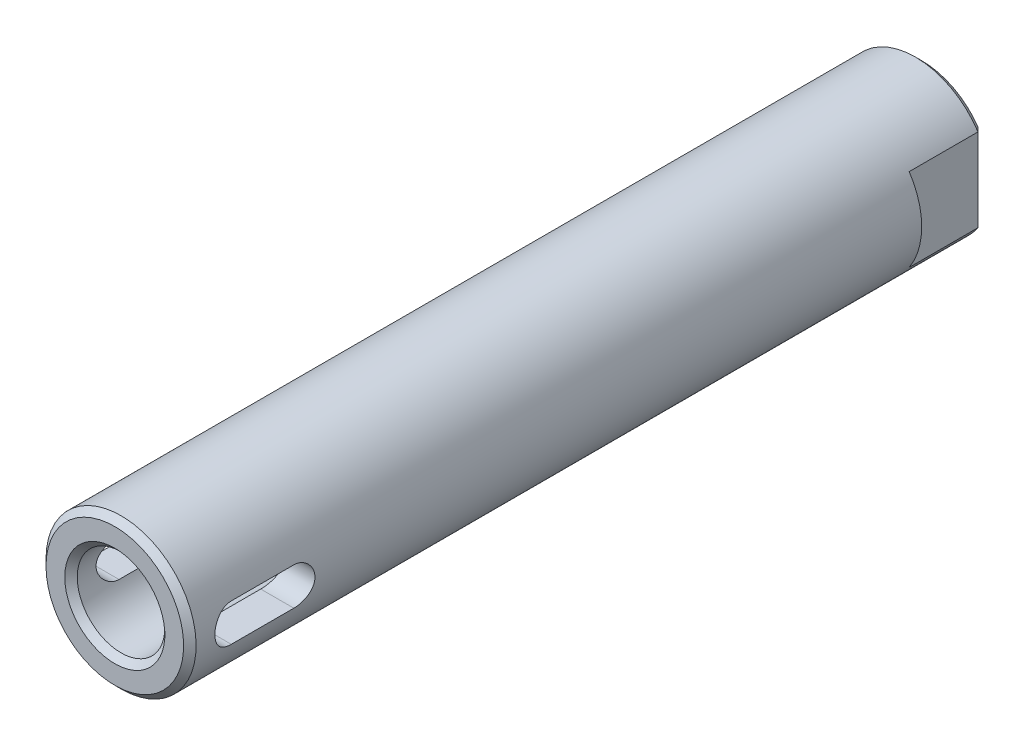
ISO-10303-21;
HEADER;
FILE_DESCRIPTION(('STEP AP214'),'2;1');
FILE_NAME('part.step','',(''),(''),'','','');
FILE_SCHEMA(('AUTOMOTIVE_DESIGN { 1 0 10303 214 1 1 1 1 }'));
ENDSEC;
DATA;
#1=APPLICATION_CONTEXT('core data for automotive mechanical design processes');
#2=APPLICATION_PROTOCOL_DEFINITION('international standard','automotive_design',2000,#1);
#3=PRODUCT_CONTEXT('',#1,'mechanical');
#4=PRODUCT('Part','Part','',(#3));
#5=PRODUCT_RELATED_PRODUCT_CATEGORY('part','',(#4));
#6=PRODUCT_DEFINITION_FORMATION('','',#4);
#7=PRODUCT_DEFINITION_CONTEXT('part definition',#1,'design');
#8=PRODUCT_DEFINITION('design','',#6,#7);
#9=PRODUCT_DEFINITION_SHAPE('','',#8);
#10=(LENGTH_UNIT() NAMED_UNIT(*) SI_UNIT(.MILLI.,.METRE.));
#11=(NAMED_UNIT(*) PLANE_ANGLE_UNIT() SI_UNIT($,.RADIAN.));
#12=(NAMED_UNIT(*) SI_UNIT($,.STERADIAN.) SOLID_ANGLE_UNIT());
#13=UNCERTAINTY_MEASURE_WITH_UNIT(LENGTH_MEASURE(1.E-05),#10,'distance_accuracy_value','');
#14=(GEOMETRIC_REPRESENTATION_CONTEXT(3) GLOBAL_UNCERTAINTY_ASSIGNED_CONTEXT((#13)) GLOBAL_UNIT_ASSIGNED_CONTEXT((#10,
#11,#12)) REPRESENTATION_CONTEXT('',''));
#15=CARTESIAN_POINT('',(0.,0.,0.));
#16=DIRECTION('',(0.,0.,1.));
#17=DIRECTION('',(1.,0.,0.));
#18=AXIS2_PLACEMENT_3D('',#15,#16,#17);
#19=CARTESIAN_POINT('',(0.,0.,0.));
#20=DIRECTION('',(0.,0.,1.));
#21=DIRECTION('',(1.,0.,0.));
#22=AXIS2_PLACEMENT_3D('',#19,#20,#21);
#23=CONICAL_SURFACE('',#22,5.5,0.785398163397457);
#24=CARTESIAN_POINT('',(0.,0.,0.));
#25=DIRECTION('',(0.,0.,-1.));
#26=DIRECTION('',(-1.,0.,0.));
#27=AXIS2_PLACEMENT_3D('',#24,#25,#26);
#28=CIRCLE('',#27,5.5);
#29=CARTESIAN_POINT('',(-4.5,3.16227766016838,0.));
#30=VERTEX_POINT('',#29);
#31=CARTESIAN_POINT('',(4.5,3.16227766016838,0.));
#32=VERTEX_POINT('',#31);
#33=EDGE_CURVE('E257',#30,#32,#28,.T.);
#34=ORIENTED_EDGE('',*,*,#33,.F.);
#35=CARTESIAN_POINT('',(-4.5,3.16227766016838,0.));
#36=CARTESIAN_POINT('',(-4.58324307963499,3.18858707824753,0.0832430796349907));
#37=CARTESIAN_POINT('',(-4.66653129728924,3.21460405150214,0.166531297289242));
#38=CARTESIAN_POINT('',(-4.83319796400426,3.26605309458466,0.333197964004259));
#39=CARTESIAN_POINT('',(-4.91657641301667,3.29148516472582,0.416576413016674));
#40=CARTESIAN_POINT('',(-5.,3.31662479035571,0.5));
#41=B_SPLINE_CURVE_WITH_KNOTS('',3,(#35,#36,#37,#38,#39,#40),.UNSPECIFIED.,.F.,.F.,(4,2,4),(0.,
0.361879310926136,0.723758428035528),.UNSPECIFIED.);
#42=CARTESIAN_POINT('',(-5.,3.31662479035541,0.5));
#43=VERTEX_POINT('',#42);
#44=EDGE_CURVE('E295',#30,#43,#41,.T.);
#45=ORIENTED_EDGE('',*,*,#44,.T.);
#46=CARTESIAN_POINT('',(0.,0.,0.5));
#47=DIRECTION('',(0.,0.,-1.));
#48=DIRECTION('',(-1.,0.,0.));
#49=AXIS2_PLACEMENT_3D('',#46,#47,#48);
#50=CIRCLE('',#49,6.);
#51=CARTESIAN_POINT('',(5.,3.31662479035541,0.5));
#52=VERTEX_POINT('',#51);
#53=EDGE_CURVE('E248',#52,#43,#50,.F.);
#54=ORIENTED_EDGE('',*,*,#53,.F.);
#55=CARTESIAN_POINT('',(5.,3.31662479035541,0.5));
#56=CARTESIAN_POINT('',(4.91657641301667,3.29148516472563,0.416576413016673));
#57=CARTESIAN_POINT('',(4.83319796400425,3.26605309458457,0.333197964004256));
#58=CARTESIAN_POINT('',(4.66653129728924,3.21460405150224,0.166531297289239));
#59=CARTESIAN_POINT('',(4.58324307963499,3.18858707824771,0.0832430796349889));
#60=CARTESIAN_POINT('',(4.5,3.16227766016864,0.));
#61=B_SPLINE_CURVE_WITH_KNOTS('',3,(#55,#56,#57,#58,#59,#60),.UNSPECIFIED.,.F.,.F.,(4,2,4),(0.,
0.361879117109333,0.723758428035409),.UNSPECIFIED.);
#62=EDGE_CURVE('E288',#52,#32,#61,.T.);
#63=ORIENTED_EDGE('',*,*,#62,.T.);
#64=EDGE_LOOP('',(#34,#45,#54,#63));
#65=FACE_BOUND('',#64,.T.);
#66=ADVANCED_FACE('F14',(#65),#23,.T.);
#67=CARTESIAN_POINT('',(0.,0.,0.));
#68=DIRECTION('',(0.,0.,1.));
#69=DIRECTION('',(1.,0.,0.));
#70=AXIS2_PLACEMENT_3D('',#67,#68,#69);
#71=CYLINDRICAL_SURFACE('',#70,6.);
#72=ORIENTED_EDGE('',*,*,#53,.T.);
#73=DIRECTION('',(0.,0.,-1.));
#74=VECTOR('',#73,1.);
#75=CARTESIAN_POINT('',(-5.,3.31662479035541,6.));
#76=LINE('',#75,#74);
#77=CARTESIAN_POINT('',(-5.,3.31662479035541,6.));
#78=VERTEX_POINT('',#77);
#79=EDGE_CURVE('E373',#78,#43,#76,.T.);
#80=ORIENTED_EDGE('',*,*,#79,.F.);
#81=CARTESIAN_POINT('',(0.,0.,6.));
#82=DIRECTION('',(0.,0.,-1.));
#83=DIRECTION('',(-1.,0.,0.));
#84=AXIS2_PLACEMENT_3D('',#81,#82,#83);
#85=CIRCLE('',#84,6.);
#86=CARTESIAN_POINT('',(-5.,-3.31662479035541,6.));
#87=VERTEX_POINT('',#86);
#88=EDGE_CURVE('E411',#87,#78,#85,.T.);
#89=ORIENTED_EDGE('',*,*,#88,.F.);
#90=DIRECTION('',(0.,0.,-1.));
#91=VECTOR('',#90,1.);
#92=CARTESIAN_POINT('',(-5.,-3.31662479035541,6.));
#93=LINE('',#92,#91);
#94=CARTESIAN_POINT('',(-5.,-3.31662479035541,0.5));
#95=VERTEX_POINT('',#94);
#96=EDGE_CURVE('E354',#87,#95,#93,.T.);
#97=ORIENTED_EDGE('',*,*,#96,.T.);
#98=CARTESIAN_POINT('',(5.,-3.31662479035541,0.5));
#99=VERTEX_POINT('',#98);
#100=EDGE_CURVE('E247',#95,#99,#50,.F.);
#101=ORIENTED_EDGE('',*,*,#100,.T.);
#102=DIRECTION('',(0.,0.,-1.));
#103=VECTOR('',#102,1.);
#104=CARTESIAN_POINT('',(5.,-3.31662479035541,6.));
#105=LINE('',#104,#103);
#106=CARTESIAN_POINT('',(5.,-3.31662479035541,6.));
#107=VERTEX_POINT('',#106);
#108=EDGE_CURVE('E352',#107,#99,#105,.T.);
#109=ORIENTED_EDGE('',*,*,#108,.F.);
#110=CARTESIAN_POINT('',(0.,0.,6.));
#111=DIRECTION('',(0.,0.,-1.));
#112=DIRECTION('',(1.,0.,0.));
#113=AXIS2_PLACEMENT_3D('',#110,#111,#112);
#114=CIRCLE('',#113,6.);
#115=CARTESIAN_POINT('',(5.,3.31662479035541,6.));
#116=VERTEX_POINT('',#115);
#117=EDGE_CURVE('E378',#116,#107,#114,.T.);
#118=ORIENTED_EDGE('',*,*,#117,.F.);
#119=DIRECTION('',(0.,0.,-1.));
#120=VECTOR('',#119,1.);
#121=CARTESIAN_POINT('',(5.,3.31662479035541,6.));
#122=LINE('',#121,#120);
#123=EDGE_CURVE('E143',#116,#52,#122,.T.);
#124=ORIENTED_EDGE('',*,*,#123,.T.);
#125=EDGE_LOOP('',(#72,#80,#89,#97,#101,#109,#118,#124));
#126=FACE_BOUND('',#125,.T.);
#127=DIRECTION('',(0.,0.,1.));
#128=VECTOR('',#127,1.);
#129=CARTESIAN_POINT('',(-5.80947501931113,1.5,0.));
#130=LINE('',#129,#128);
#131=CARTESIAN_POINT('',(-5.80947501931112,1.5,56.));
#132=VERTEX_POINT('',#131);
#133=CARTESIAN_POINT('',(-5.80947501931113,1.5,61.));
#134=VERTEX_POINT('',#133);
#135=EDGE_CURVE('E399',#132,#134,#130,.T.);
#136=ORIENTED_EDGE('',*,*,#135,.T.);
#137=CARTESIAN_POINT('',(-5.80947501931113,1.5,61.));
#138=CARTESIAN_POINT('',(-5.80947222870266,1.50000050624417,61.0414944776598));
#139=CARTESIAN_POINT('',(-5.80992014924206,1.49827711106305,61.0829683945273));
#140=CARTESIAN_POINT('',(-5.81168857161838,1.49140694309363,61.1656060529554));
#141=CARTESIAN_POINT('',(-5.8130089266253,1.48626074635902,61.2067698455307));
#142=CARTESIAN_POINT('',(-5.81822566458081,1.46576285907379,61.3291797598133));
#143=CARTESIAN_POINT('',(-5.82337804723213,1.44535154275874,61.4095847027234));
#144=CARTESIAN_POINT('',(-5.83643133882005,1.39169711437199,61.565687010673));
#145=CARTESIAN_POINT('',(-5.84433198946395,1.35845520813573,61.6413848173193));
#146=CARTESIAN_POINT('',(-5.86198701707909,1.28012306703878,61.786167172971));
#147=CARTESIAN_POINT('',(-5.87174189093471,1.2350296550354,61.8552499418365));
#148=CARTESIAN_POINT('',(-5.89224393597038,1.1332267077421,61.9863158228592));
#149=CARTESIAN_POINT('',(-5.90300686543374,1.07630590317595,62.0481323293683));
#150=CARTESIAN_POINT('',(-5.92417656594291,0.952913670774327,62.1614531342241));
#151=CARTESIAN_POINT('',(-5.93458327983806,0.886440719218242,62.2129557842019));
#152=CARTESIAN_POINT('',(-5.95404273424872,0.744685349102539,62.304866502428));
#153=CARTESIAN_POINT('',(-5.96307457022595,0.669293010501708,62.345109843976));
#154=CARTESIAN_POINT('',(-5.97858519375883,0.512553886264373,62.412287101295));
#155=CARTESIAN_POINT('',(-5.98506448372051,0.431208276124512,62.4392236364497));
#156=CARTESIAN_POINT('',(-5.99462850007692,0.26661616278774,62.4784884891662));
#157=CARTESIAN_POINT('',(-5.99777929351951,0.183441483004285,62.4911015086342));
#158=CARTESIAN_POINT('',(-6.00056157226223,0.0160991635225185,62.5022550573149));
#159=CARTESIAN_POINT('',(-6.00019349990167,-0.0680683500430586,62.5007973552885));
#160=CARTESIAN_POINT('',(-5.99602856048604,-0.233028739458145,62.4840550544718));
#161=CARTESIAN_POINT('',(-5.99230798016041,-0.313855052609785,62.4690780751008));
#162=CARTESIAN_POINT('',(-5.98194495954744,-0.471808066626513,62.4262169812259));
#163=CARTESIAN_POINT('',(-5.97530238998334,-0.548934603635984,62.3983322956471));
#164=CARTESIAN_POINT('',(-5.95972496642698,-0.698110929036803,62.330198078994));
#165=CARTESIAN_POINT('',(-5.95076990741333,-0.770108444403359,62.2898389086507));
#166=CARTESIAN_POINT('',(-5.93153918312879,-0.906414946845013,62.1979853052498));
#167=CARTESIAN_POINT('',(-5.92126331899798,-0.970722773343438,62.1464891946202));
#168=CARTESIAN_POINT('',(-5.90018349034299,-1.09165408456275,62.0321816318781));
#169=CARTESIAN_POINT('',(-5.88937275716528,-1.14802365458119,61.9691025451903));
#170=CARTESIAN_POINT('',(-5.8686925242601,-1.24945436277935,61.8342551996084));
#171=CARTESIAN_POINT('',(-5.85882328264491,-1.29451240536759,61.7624845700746));
#172=CARTESIAN_POINT('',(-5.84111720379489,-1.37220706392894,61.6117816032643));
#173=CARTESIAN_POINT('',(-5.83329159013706,-1.4047755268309,61.5328128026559));
#174=CARTESIAN_POINT('',(-5.82070588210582,-1.45605352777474,61.3703246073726));
#175=CARTESIAN_POINT('',(-5.81594120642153,-1.4747837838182,61.2868122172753));
#176=CARTESIAN_POINT('',(-5.81182936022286,-1.49085695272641,61.1688139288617));
#177=CARTESIAN_POINT('',(-5.81094784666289,-1.49428618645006,61.1351204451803));
#178=CARTESIAN_POINT('',(-5.80977093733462,-1.49885513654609,61.067623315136));
#179=CARTESIAN_POINT('',(-5.80947459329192,-1.49999855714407,61.0338199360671));
#180=CARTESIAN_POINT('',(-5.80947501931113,-1.5,61.));
#181=B_SPLINE_CURVE_WITH_KNOTS('',3,(#137,#138,#139,#140,#141,#142,#143,#144,#145,#146,#147,
#148,#149,#150,#151,#152,#153,#154,#155,#156,#157,#158,#159,#160,#161,#162,#163,#164,#165,#166,
#167,#168,#169,#170,#171,#172,#173,#174,#175,#176,#177,#178,#179,#180),.UNSPECIFIED.,.F.,.F.,(4,
2,2,2,2,2,2,2,2,2,2,2,2,2,2,2,2,2,2,2,2,4),(0.,0.124404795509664,0.248788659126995,
0.496844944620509,0.744877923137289,0.992977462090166,1.24596284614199,1.49898863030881,
1.75554280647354,2.01204646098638,2.26335722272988,2.51463639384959,2.76033818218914,
3.00605084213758,3.25398764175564,3.5019618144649,3.75662144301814,4.01135068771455,
4.26745080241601,4.52316671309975,4.6247377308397,4.72614401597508),.UNSPECIFIED.);
#182=CARTESIAN_POINT('',(-5.80947501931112,-1.5,61.));
#183=VERTEX_POINT('',#182);
#184=EDGE_CURVE('E158',#134,#183,#181,.T.);
#185=ORIENTED_EDGE('',*,*,#184,.T.);
#186=DIRECTION('',(0.,0.,1.));
#187=VECTOR('',#186,1.);
#188=CARTESIAN_POINT('',(-5.80947501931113,-1.5,0.));
#189=LINE('',#188,#187);
#190=CARTESIAN_POINT('',(-5.80947501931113,-1.5,56.));
#191=VERTEX_POINT('',#190);
#192=EDGE_CURVE('E146',#183,#191,#189,.F.);
#193=ORIENTED_EDGE('',*,*,#192,.T.);
#194=CARTESIAN_POINT('',(-5.80947501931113,-1.5,56.));
#195=CARTESIAN_POINT('',(-5.80947222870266,-1.50000050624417,55.9585055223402));
#196=CARTESIAN_POINT('',(-5.80992014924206,-1.49827711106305,55.9170316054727));
#197=CARTESIAN_POINT('',(-5.81168857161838,-1.49140694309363,55.8343939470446));
#198=CARTESIAN_POINT('',(-5.81300892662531,-1.48626074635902,55.7932301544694));
#199=CARTESIAN_POINT('',(-5.81822566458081,-1.46576285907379,55.6708202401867));
#200=CARTESIAN_POINT('',(-5.82337804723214,-1.44535154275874,55.5904152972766));
#201=CARTESIAN_POINT('',(-5.83643133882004,-1.39169711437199,55.434312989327));
#202=CARTESIAN_POINT('',(-5.84433198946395,-1.35845520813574,55.3586151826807));
#203=CARTESIAN_POINT('',(-5.86198701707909,-1.28012306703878,55.213832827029));
#204=CARTESIAN_POINT('',(-5.8717418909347,-1.2350296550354,55.1447500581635));
#205=CARTESIAN_POINT('',(-5.89224393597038,-1.1332267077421,55.0136841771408));
#206=CARTESIAN_POINT('',(-5.90300686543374,-1.07630590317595,54.9518676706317));
#207=CARTESIAN_POINT('',(-5.92417656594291,-0.952913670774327,54.8385468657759));
#208=CARTESIAN_POINT('',(-5.93458327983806,-0.886440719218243,54.7870442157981));
#209=CARTESIAN_POINT('',(-5.95404273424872,-0.74468534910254,54.695133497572));
#210=CARTESIAN_POINT('',(-5.96307457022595,-0.669293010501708,54.654890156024));
#211=CARTESIAN_POINT('',(-5.97858519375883,-0.512553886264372,54.587712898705));
#212=CARTESIAN_POINT('',(-5.98506448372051,-0.431208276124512,54.5607763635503));
#213=CARTESIAN_POINT('',(-5.99462850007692,-0.266616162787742,54.5215115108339));
#214=CARTESIAN_POINT('',(-5.99777929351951,-0.183441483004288,54.5088984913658));
#215=CARTESIAN_POINT('',(-6.00056157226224,-0.0160991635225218,54.4977449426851));
#216=CARTESIAN_POINT('',(-6.00019349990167,0.0680683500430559,54.4992026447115));
#217=CARTESIAN_POINT('',(-5.99602856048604,0.233028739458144,54.5159449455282));
#218=CARTESIAN_POINT('',(-5.99230798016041,0.313855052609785,54.5309219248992));
#219=CARTESIAN_POINT('',(-5.98194495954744,0.471808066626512,54.5737830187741));
#220=CARTESIAN_POINT('',(-5.97530238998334,0.54893460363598,54.6016677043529));
#221=CARTESIAN_POINT('',(-5.95972496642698,0.698110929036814,54.669801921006));
#222=CARTESIAN_POINT('',(-5.95076990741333,0.770108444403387,54.7101610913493));
#223=CARTESIAN_POINT('',(-5.93153918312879,0.906414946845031,54.8020146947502));
#224=CARTESIAN_POINT('',(-5.92126331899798,0.970722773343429,54.8535108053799));
#225=CARTESIAN_POINT('',(-5.90018349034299,1.09165408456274,54.967818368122));
#226=CARTESIAN_POINT('',(-5.88937275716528,1.14802365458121,55.0308974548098));
#227=CARTESIAN_POINT('',(-5.86869252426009,1.24945436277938,55.1657448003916));
#228=CARTESIAN_POINT('',(-5.8588232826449,1.2945124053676,55.2375154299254));
#229=CARTESIAN_POINT('',(-5.84111720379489,1.37220706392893,55.3882183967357));
#230=CARTESIAN_POINT('',(-5.83329159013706,1.4047755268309,55.4671871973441));
#231=CARTESIAN_POINT('',(-5.82070588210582,1.45605352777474,55.6296753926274));
#232=CARTESIAN_POINT('',(-5.81594120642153,1.4747837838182,55.7131877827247));
#233=CARTESIAN_POINT('',(-5.81182936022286,1.49085695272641,55.8311860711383));
#234=CARTESIAN_POINT('',(-5.81094784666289,1.49428618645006,55.8648795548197));
#235=CARTESIAN_POINT('',(-5.80977093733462,1.49885513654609,55.932376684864));
#236=CARTESIAN_POINT('',(-5.80947459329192,1.49999855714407,55.9661800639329));
#237=CARTESIAN_POINT('',(-5.80947501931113,1.5,56.));
#238=B_SPLINE_CURVE_WITH_KNOTS('',3,(#194,#195,#196,#197,#198,#199,#200,#201,#202,#203,#204,
#205,#206,#207,#208,#209,#210,#211,#212,#213,#214,#215,#216,#217,#218,#219,#220,#221,#222,#223,
#224,#225,#226,#227,#228,#229,#230,#231,#232,#233,#234,#235,#236,#237),.UNSPECIFIED.,.F.,.F.,(4,
2,2,2,2,2,2,2,2,2,2,2,2,2,2,2,2,2,2,2,2,4),(0.,0.124404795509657,0.248788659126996,
0.496844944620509,0.744877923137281,0.99297746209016,1.24596284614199,1.49898863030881,
1.75554280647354,2.01204646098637,2.26335722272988,2.51463639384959,2.76033818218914,
3.00605084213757,3.25398764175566,3.50196181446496,3.75662144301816,4.01135068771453,
4.267450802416,4.52316671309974,4.62473773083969,4.72614401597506),.UNSPECIFIED.);
#239=EDGE_CURVE('E240',#191,#132,#238,.T.);
#240=ORIENTED_EDGE('',*,*,#239,.T.);
#241=EDGE_LOOP('',(#136,#185,#193,#240));
#242=FACE_BOUND('',#241,.T.);
#243=DIRECTION('',(0.,0.,1.));
#244=VECTOR('',#243,1.);
#245=CARTESIAN_POINT('',(5.80947501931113,-1.5,0.));
#246=LINE('',#245,#244);
#247=CARTESIAN_POINT('',(5.80947501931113,-1.5,56.));
#248=VERTEX_POINT('',#247);
#249=CARTESIAN_POINT('',(5.80947501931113,-1.5,61.));
#250=VERTEX_POINT('',#249);
#251=EDGE_CURVE('E137',#248,#250,#246,.T.);
#252=ORIENTED_EDGE('',*,*,#251,.T.);
#253=CARTESIAN_POINT('',(5.80947501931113,-1.5,61.));
#254=CARTESIAN_POINT('',(5.80947222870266,-1.50000050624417,61.0414944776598));
#255=CARTESIAN_POINT('',(5.80992014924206,-1.49827711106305,61.0829683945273));
#256=CARTESIAN_POINT('',(5.81168857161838,-1.49140694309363,61.1656060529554));
#257=CARTESIAN_POINT('',(5.81300892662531,-1.48626074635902,61.2067698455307));
#258=CARTESIAN_POINT('',(5.81822566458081,-1.46576285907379,61.3291797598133));
#259=CARTESIAN_POINT('',(5.82337804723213,-1.44535154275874,61.4095847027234));
#260=CARTESIAN_POINT('',(5.83643133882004,-1.39169711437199,61.565687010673));
#261=CARTESIAN_POINT('',(5.84433198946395,-1.35845520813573,61.6413848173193));
#262=CARTESIAN_POINT('',(5.86198701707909,-1.28012306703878,61.786167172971));
#263=CARTESIAN_POINT('',(5.87174189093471,-1.2350296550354,61.8552499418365));
#264=CARTESIAN_POINT('',(5.89224393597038,-1.13322670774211,61.9863158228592));
#265=CARTESIAN_POINT('',(5.90300686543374,-1.07630590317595,62.0481323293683));
#266=CARTESIAN_POINT('',(5.92417656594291,-0.952913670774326,62.1614531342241));
#267=CARTESIAN_POINT('',(5.93458327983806,-0.886440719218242,62.2129557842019));
#268=CARTESIAN_POINT('',(5.95404273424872,-0.74468534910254,62.304866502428));
#269=CARTESIAN_POINT('',(5.96307457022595,-0.669293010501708,62.345109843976));
#270=CARTESIAN_POINT('',(5.97858519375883,-0.512553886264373,62.412287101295));
#271=CARTESIAN_POINT('',(5.98506448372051,-0.431208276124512,62.4392236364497));
#272=CARTESIAN_POINT('',(5.99462850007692,-0.266616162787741,62.4784884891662));
#273=CARTESIAN_POINT('',(5.99777929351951,-0.183441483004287,62.4911015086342));
#274=CARTESIAN_POINT('',(6.00056157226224,-0.01609916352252,62.5022550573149));
#275=CARTESIAN_POINT('',(6.00019349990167,0.0680683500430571,62.5007973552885));
#276=CARTESIAN_POINT('',(5.99602856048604,0.233028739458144,62.4840550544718));
#277=CARTESIAN_POINT('',(5.99230798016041,0.313855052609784,62.4690780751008));
#278=CARTESIAN_POINT('',(5.98194495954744,0.471808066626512,62.4262169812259));
#279=CARTESIAN_POINT('',(5.97530238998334,0.548934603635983,62.3983322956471));
#280=CARTESIAN_POINT('',(5.95972496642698,0.698110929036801,62.330198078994));
#281=CARTESIAN_POINT('',(5.95076990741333,0.770108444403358,62.2898389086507));
#282=CARTESIAN_POINT('',(5.93153918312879,0.906414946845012,62.1979853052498));
#283=CARTESIAN_POINT('',(5.92126331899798,0.970722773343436,62.1464891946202));
#284=CARTESIAN_POINT('',(5.90018349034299,1.09165408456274,62.0321816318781));
#285=CARTESIAN_POINT('',(5.88937275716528,1.14802365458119,61.9691025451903));
#286=CARTESIAN_POINT('',(5.8686925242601,1.24945436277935,61.8342551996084));
#287=CARTESIAN_POINT('',(5.85882328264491,1.29451240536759,61.7624845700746));
#288=CARTESIAN_POINT('',(5.84111720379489,1.37220706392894,61.6117816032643));
#289=CARTESIAN_POINT('',(5.83329159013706,1.4047755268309,61.5328128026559));
#290=CARTESIAN_POINT('',(5.82070588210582,1.45605352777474,61.3703246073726));
#291=CARTESIAN_POINT('',(5.81594120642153,1.4747837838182,61.2868122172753));
#292=CARTESIAN_POINT('',(5.81182936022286,1.49085695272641,61.1688139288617));
#293=CARTESIAN_POINT('',(5.81094784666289,1.49428618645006,61.1351204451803));
#294=CARTESIAN_POINT('',(5.80977093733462,1.49885513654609,61.067623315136));
#295=CARTESIAN_POINT('',(5.80947459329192,1.49999855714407,61.0338199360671));
#296=CARTESIAN_POINT('',(5.80947501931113,1.5,61.));
#297=B_SPLINE_CURVE_WITH_KNOTS('',3,(#253,#254,#255,#256,#257,#258,#259,#260,#261,#262,#263,
#264,#265,#266,#267,#268,#269,#270,#271,#272,#273,#274,#275,#276,#277,#278,#279,#280,#281,#282,
#283,#284,#285,#286,#287,#288,#289,#290,#291,#292,#293,#294,#295,#296),.UNSPECIFIED.,.F.,.F.,(4,
2,2,2,2,2,2,2,2,2,2,2,2,2,2,2,2,2,2,2,2,4),(0.,0.124404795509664,0.248788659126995,
0.496844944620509,0.744877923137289,0.992977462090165,1.24596284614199,1.49898863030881,
1.75554280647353,2.01204646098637,2.26335722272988,2.51463639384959,2.76033818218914,
3.00605084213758,3.25398764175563,3.5019618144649,3.75662144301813,4.01135068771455,
4.26745080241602,4.52316671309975,4.6247377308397,4.72614401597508),.UNSPECIFIED.);
#298=CARTESIAN_POINT('',(5.80947501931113,1.5,61.));
#299=VERTEX_POINT('',#298);
#300=EDGE_CURVE('E150',#250,#299,#297,.T.);
#301=ORIENTED_EDGE('',*,*,#300,.T.);
#302=DIRECTION('',(0.,0.,1.));
#303=VECTOR('',#302,1.);
#304=CARTESIAN_POINT('',(5.80947501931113,1.5,0.));
#305=LINE('',#304,#303);
#306=CARTESIAN_POINT('',(5.80947501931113,1.5,56.));
#307=VERTEX_POINT('',#306);
#308=EDGE_CURVE('E398',#299,#307,#305,.F.);
#309=ORIENTED_EDGE('',*,*,#308,.T.);
#310=CARTESIAN_POINT('',(5.80947501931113,1.5,56.));
#311=CARTESIAN_POINT('',(5.80947222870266,1.50000050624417,55.9585055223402));
#312=CARTESIAN_POINT('',(5.80992014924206,1.49827711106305,55.9170316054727));
#313=CARTESIAN_POINT('',(5.81168857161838,1.49140694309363,55.8343939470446));
#314=CARTESIAN_POINT('',(5.81300892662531,1.48626074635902,55.7932301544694));
#315=CARTESIAN_POINT('',(5.81822566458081,1.46576285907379,55.6708202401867));
#316=CARTESIAN_POINT('',(5.82337804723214,1.44535154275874,55.5904152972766));
#317=CARTESIAN_POINT('',(5.83643133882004,1.39169711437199,55.434312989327));
#318=CARTESIAN_POINT('',(5.84433198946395,1.35845520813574,55.3586151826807));
#319=CARTESIAN_POINT('',(5.86198701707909,1.28012306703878,55.213832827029));
#320=CARTESIAN_POINT('',(5.8717418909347,1.2350296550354,55.1447500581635));
#321=CARTESIAN_POINT('',(5.89224393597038,1.1332267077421,55.0136841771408));
#322=CARTESIAN_POINT('',(5.90300686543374,1.07630590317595,54.9518676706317));
#323=CARTESIAN_POINT('',(5.92417656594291,0.952913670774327,54.8385468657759));
#324=CARTESIAN_POINT('',(5.93458327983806,0.886440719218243,54.7870442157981));
#325=CARTESIAN_POINT('',(5.95404273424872,0.74468534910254,54.695133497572));
#326=CARTESIAN_POINT('',(5.96307457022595,0.669293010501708,54.654890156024));
#327=CARTESIAN_POINT('',(5.97858519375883,0.512553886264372,54.587712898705));
#328=CARTESIAN_POINT('',(5.98506448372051,0.431208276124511,54.5607763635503));
#329=CARTESIAN_POINT('',(5.99462850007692,0.266616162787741,54.5215115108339));
#330=CARTESIAN_POINT('',(5.99777929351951,0.183441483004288,54.5088984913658));
#331=CARTESIAN_POINT('',(6.00056157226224,0.0160991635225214,54.4977449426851));
#332=CARTESIAN_POINT('',(6.00019349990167,-0.0680683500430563,54.4992026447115));
#333=CARTESIAN_POINT('',(5.99602856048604,-0.233028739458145,54.5159449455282));
#334=CARTESIAN_POINT('',(5.99230798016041,-0.313855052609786,54.5309219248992));
#335=CARTESIAN_POINT('',(5.98194495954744,-0.471808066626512,54.5737830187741));
#336=CARTESIAN_POINT('',(5.97530238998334,-0.54893460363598,54.6016677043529));
#337=CARTESIAN_POINT('',(5.95972496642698,-0.698110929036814,54.669801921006));
#338=CARTESIAN_POINT('',(5.95076990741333,-0.770108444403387,54.7101610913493));
#339=CARTESIAN_POINT('',(5.93153918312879,-0.906414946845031,54.8020146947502));
#340=CARTESIAN_POINT('',(5.92126331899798,-0.970722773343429,54.8535108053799));
#341=CARTESIAN_POINT('',(5.90018349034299,-1.09165408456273,54.967818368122));
#342=CARTESIAN_POINT('',(5.88937275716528,-1.14802365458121,55.0308974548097));
#343=CARTESIAN_POINT('',(5.86869252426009,-1.24945436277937,55.1657448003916));
#344=CARTESIAN_POINT('',(5.8588232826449,-1.29451240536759,55.2375154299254));
#345=CARTESIAN_POINT('',(5.84111720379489,-1.37220706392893,55.3882183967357));
#346=CARTESIAN_POINT('',(5.83329159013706,-1.4047755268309,55.4671871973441));
#347=CARTESIAN_POINT('',(5.82070588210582,-1.45605352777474,55.6296753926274));
#348=CARTESIAN_POINT('',(5.81594120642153,-1.4747837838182,55.7131877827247));
#349=CARTESIAN_POINT('',(5.81182936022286,-1.49085695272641,55.8311860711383));
#350=CARTESIAN_POINT('',(5.81094784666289,-1.49428618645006,55.8648795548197));
#351=CARTESIAN_POINT('',(5.80977093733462,-1.49885513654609,55.932376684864));
#352=CARTESIAN_POINT('',(5.80947459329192,-1.49999855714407,55.9661800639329));
#353=CARTESIAN_POINT('',(5.80947501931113,-1.5,56.));
#354=B_SPLINE_CURVE_WITH_KNOTS('',3,(#310,#311,#312,#313,#314,#315,#316,#317,#318,#319,#320,
#321,#322,#323,#324,#325,#326,#327,#328,#329,#330,#331,#332,#333,#334,#335,#336,#337,#338,#339,
#340,#341,#342,#343,#344,#345,#346,#347,#348,#349,#350,#351,#352,#353),.UNSPECIFIED.,.F.,.F.,(4,
2,2,2,2,2,2,2,2,2,2,2,2,2,2,2,2,2,2,2,2,4),(0.,0.124404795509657,0.248788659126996,
0.496844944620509,0.744877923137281,0.99297746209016,1.24596284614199,1.49898863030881,
1.75554280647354,2.01204646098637,2.26335722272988,2.51463639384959,2.76033818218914,
3.00605084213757,3.25398764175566,3.50196181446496,3.75662144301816,4.01135068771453,
4.267450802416,4.52316671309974,4.62473773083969,4.72614401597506),.UNSPECIFIED.);
#355=EDGE_CURVE('E233',#307,#248,#354,.T.);
#356=ORIENTED_EDGE('',*,*,#355,.T.);
#357=EDGE_LOOP('',(#252,#301,#309,#356));
#358=FACE_BOUND('',#357,.T.);
#359=CARTESIAN_POINT('',(0.,0.,64.));
#360=DIRECTION('',(0.,0.,-1.));
#361=DIRECTION('',(-1.,0.,0.));
#362=AXIS2_PLACEMENT_3D('',#359,#360,#361);
#363=CIRCLE('',#362,6.);
#364=CARTESIAN_POINT('',(-6.,0.,64.));
#365=VERTEX_POINT('',#364);
#366=EDGE_CURVE('E251',#365,#365,#363,.T.);
#367=ORIENTED_EDGE('',*,*,#366,.T.);
#368=EDGE_LOOP('',(#367));
#369=FACE_BOUND('',#368,.T.);
#370=ADVANCED_FACE('F164',(#126,#242,#358,#369),#71,.T.);
#371=CARTESIAN_POINT('',(0.,0.,0.));
#372=DIRECTION('',(0.,0.,-1.));
#373=DIRECTION('',(-1.,0.,0.));
#374=AXIS2_PLACEMENT_3D('',#371,#372,#373);
#375=PLANE('',#374);
#376=CARTESIAN_POINT('',(0.,0.,0.));
#377=DIRECTION('',(0.,0.,-1.));
#378=DIRECTION('',(-1.,0.,0.));
#379=AXIS2_PLACEMENT_3D('',#376,#377,#378);
#380=CIRCLE('',#379,2.95);
#381=CARTESIAN_POINT('',(-2.95,0.,0.));
#382=VERTEX_POINT('',#381);
#383=EDGE_CURVE('E9',#382,#382,#380,.F.);
#384=ORIENTED_EDGE('',*,*,#383,.T.);
#385=EDGE_LOOP('',(#384));
#386=FACE_BOUND('',#385,.T.);
#387=CARTESIAN_POINT('',(4.5,-3.16227766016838,0.));
#388=VERTEX_POINT('',#387);
#389=CARTESIAN_POINT('',(-4.5,-3.16227766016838,0.));
#390=VERTEX_POINT('',#389);
#391=EDGE_CURVE('E260',#388,#390,#28,.T.);
#392=ORIENTED_EDGE('',*,*,#391,.T.);
#393=DIRECTION('',(0.,1.,0.));
#394=VECTOR('',#393,1.);
#395=CARTESIAN_POINT('',(-4.5,2.29128784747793,0.));
#396=LINE('',#395,#394);
#397=EDGE_CURVE('E296',#390,#30,#396,.T.);
#398=ORIENTED_EDGE('',*,*,#397,.T.);
#399=ORIENTED_EDGE('',*,*,#33,.T.);
#400=DIRECTION('',(0.,-1.,0.));
#401=VECTOR('',#400,1.);
#402=CARTESIAN_POINT('',(4.5,-2.29128784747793,0.));
#403=LINE('',#402,#401);
#404=EDGE_CURVE('E362',#32,#388,#403,.T.);
#405=ORIENTED_EDGE('',*,*,#404,.T.);
#406=EDGE_LOOP('',(#392,#398,#399,#405));
#407=FACE_BOUND('',#406,.T.);
#408=ADVANCED_FACE('F228',(#386,#407),#375,.T.);
#409=CARTESIAN_POINT('',(0.,0.,64.5));
#410=DIRECTION('',(0.,0.,-1.));
#411=DIRECTION('',(-1.,0.,0.));
#412=AXIS2_PLACEMENT_3D('',#409,#410,#411);
#413=PLANE('',#412);
#414=CARTESIAN_POINT('',(0.,0.,64.5));
#415=DIRECTION('',(0.,0.,-1.));
#416=DIRECTION('',(-1.,0.,0.));
#417=AXIS2_PLACEMENT_3D('',#414,#415,#416);
#418=CIRCLE('',#417,4.);
#419=CARTESIAN_POINT('',(-4.,0.,64.5));
#420=VERTEX_POINT('',#419);
#421=EDGE_CURVE('E306',#420,#420,#418,.T.);
#422=ORIENTED_EDGE('',*,*,#421,.T.);
#423=EDGE_LOOP('',(#422));
#424=FACE_BOUND('',#423,.T.);
#425=CARTESIAN_POINT('',(0.,0.,64.5));
#426=DIRECTION('',(0.,0.,-1.));
#427=DIRECTION('',(-1.,0.,0.));
#428=AXIS2_PLACEMENT_3D('',#425,#426,#427);
#429=CIRCLE('',#428,5.5);
#430=CARTESIAN_POINT('',(-5.5,0.,64.5));
#431=VERTEX_POINT('',#430);
#432=EDGE_CURVE('E254',#431,#431,#429,.F.);
#433=ORIENTED_EDGE('',*,*,#432,.T.);
#434=EDGE_LOOP('',(#433));
#435=FACE_BOUND('',#434,.T.);
#436=ADVANCED_FACE('F572',(#424,#435),#413,.F.);
#437=CARTESIAN_POINT('',(6.,-1.5,56.));
#438=DIRECTION('',(0.,-1.,0.));
#439=DIRECTION('',(0.,0.,1.));
#440=AXIS2_PLACEMENT_3D('',#437,#438,#439);
#441=PLANE('',#440);
#442=DIRECTION('',(-1.,0.,0.));
#443=VECTOR('',#442,1.);
#444=CARTESIAN_POINT('',(6.,-1.5,61.));
#445=LINE('',#444,#443);
#446=CARTESIAN_POINT('',(-3.16227766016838,-1.5,61.));
#447=VERTEX_POINT('',#446);
#448=EDGE_CURVE('E138',#447,#183,#445,.T.);
#449=ORIENTED_EDGE('',*,*,#448,.F.);
#450=DIRECTION('',(0.,0.,1.));
#451=VECTOR('',#450,1.);
#452=CARTESIAN_POINT('',(-3.16227766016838,-1.5,64.5));
#453=LINE('',#452,#451);
#454=CARTESIAN_POINT('',(-3.16227766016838,-1.5,56.));
#455=VERTEX_POINT('',#454);
#456=EDGE_CURVE('E408',#447,#455,#453,.F.);
#457=ORIENTED_EDGE('',*,*,#456,.T.);
#458=DIRECTION('',(-1.,0.,0.));
#459=VECTOR('',#458,1.);
#460=CARTESIAN_POINT('',(6.,-1.5,56.));
#461=LINE('',#460,#459);
#462=EDGE_CURVE('E139',#455,#191,#461,.T.);
#463=ORIENTED_EDGE('',*,*,#462,.T.);
#464=ORIENTED_EDGE('',*,*,#192,.F.);
#465=EDGE_LOOP('',(#449,#457,#463,#464));
#466=FACE_BOUND('',#465,.T.);
#467=ADVANCED_FACE('F174',(#466),#441,.F.);
#468=CARTESIAN_POINT('',(6.,0.,61.));
#469=DIRECTION('',(-1.,0.,0.));
#470=DIRECTION('',(0.,0.,1.));
#471=AXIS2_PLACEMENT_3D('',#468,#469,#470);
#472=CYLINDRICAL_SURFACE('',#471,1.5);
#473=DIRECTION('',(-1.,0.,0.));
#474=VECTOR('',#473,1.);
#475=CARTESIAN_POINT('',(6.,1.5,61.));
#476=LINE('',#475,#474);
#477=CARTESIAN_POINT('',(-3.16227766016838,1.5,61.));
#478=VERTEX_POINT('',#477);
#479=EDGE_CURVE('E385',#478,#134,#476,.T.);
#480=ORIENTED_EDGE('',*,*,#479,.F.);
#481=CARTESIAN_POINT('',(-3.16227766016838,1.5,61.));
#482=CARTESIAN_POINT('',(-3.16227172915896,1.50000205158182,61.0400864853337));
#483=CARTESIAN_POINT('',(-3.1630408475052,1.49839203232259,61.0801514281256));
#484=CARTESIAN_POINT('',(-3.16607042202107,1.49198428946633,61.1599515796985));
#485=CARTESIAN_POINT('',(-3.16833022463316,1.48718796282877,61.1996869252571));
#486=CARTESIAN_POINT('',(-3.17722728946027,1.46813912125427,61.3176062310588));
#487=CARTESIAN_POINT('',(-3.18598345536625,1.44922583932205,61.3949312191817));
#488=CARTESIAN_POINT('',(-3.20801790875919,1.39976461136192,61.5448843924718));
#489=CARTESIAN_POINT('',(-3.2212903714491,1.36923164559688,61.6175184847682));
#490=CARTESIAN_POINT('',(-3.25084584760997,1.29749907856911,61.7567257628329));
#491=CARTESIAN_POINT('',(-3.26713219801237,1.25628763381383,61.8232921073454));
#492=CARTESIAN_POINT('',(-3.30205717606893,1.1615127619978,61.9527322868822));
#493=CARTESIAN_POINT('',(-3.32077798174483,1.10736251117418,62.0151542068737));
#494=CARTESIAN_POINT('',(-3.35778717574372,0.989484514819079,62.1303603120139));
#495=CARTESIAN_POINT('',(-3.37607546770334,0.92575465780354,62.1831423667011));
#496=CARTESIAN_POINT('',(-3.41118224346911,0.786887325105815,62.279959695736));
#497=CARTESIAN_POINT('',(-3.42789299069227,0.711357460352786,62.3234747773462));
#498=CARTESIAN_POINT('',(-3.45693715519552,0.553203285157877,62.3969821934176));
#499=CARTESIAN_POINT('',(-3.46927263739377,0.470582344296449,62.4269809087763));
#500=CARTESIAN_POINT('',(-3.48758727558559,0.305382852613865,62.4709323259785));
#501=CARTESIAN_POINT('',(-3.49387712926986,0.22304904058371,62.4856727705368));
#502=CARTESIAN_POINT('',(-3.50052462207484,0.05685120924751,62.5012413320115));
#503=CARTESIAN_POINT('',(-3.5008847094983,-0.0270121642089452,62.5020751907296));
#504=CARTESIAN_POINT('',(-3.49581014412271,-0.188134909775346,62.4902048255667));
#505=CARTESIAN_POINT('',(-3.49074670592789,-0.265472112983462,62.4783678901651));
#506=CARTESIAN_POINT('',(-3.4759108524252,-0.416937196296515,62.4429875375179));
#507=CARTESIAN_POINT('',(-3.46613817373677,-0.491064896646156,62.4194434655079));
#508=CARTESIAN_POINT('',(-3.44263354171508,-0.635378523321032,62.361046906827));
#509=CARTESIAN_POINT('',(-3.42884327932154,-0.705486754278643,62.326026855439));
#510=CARTESIAN_POINT('',(-3.39863858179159,-0.839016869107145,62.2458418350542));
#511=CARTESIAN_POINT('',(-3.38222317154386,-0.902436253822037,62.2006730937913));
#512=CARTESIAN_POINT('',(-3.34697002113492,-1.02577016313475,62.097598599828));
#513=CARTESIAN_POINT('',(-3.32804291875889,-1.08507946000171,62.0389983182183));
#514=CARTESIAN_POINT('',(-3.29079030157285,-1.19330742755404,61.9126556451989));
#515=CARTESIAN_POINT('',(-3.27246512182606,-1.24222039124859,61.8449082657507));
#516=CARTESIAN_POINT('',(-3.23782407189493,-1.32996504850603,61.6990708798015));
#517=CARTESIAN_POINT('',(-3.22160763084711,-1.36835678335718,61.6206909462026));
#518=CARTESIAN_POINT('',(-3.19423395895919,-1.43110327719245,61.4577447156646));
#519=CARTESIAN_POINT('',(-3.18306711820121,-1.45548472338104,61.3731905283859));
#520=CARTESIAN_POINT('',(-3.17100823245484,-1.4814873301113,61.2398104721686));
#521=CARTESIAN_POINT('',(-3.16775315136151,-1.48841599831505,61.1921753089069));
#522=CARTESIAN_POINT('',(-3.16338096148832,-1.49767523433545,61.0963713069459));
#523=CARTESIAN_POINT('',(-3.1622635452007,-1.50000646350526,61.0482025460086));
#524=CARTESIAN_POINT('',(-3.16227766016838,-1.5,61.));
#525=B_SPLINE_CURVE_WITH_KNOTS('',3,(#481,#482,#483,#484,#485,#486,#487,#488,#489,#490,#491,
#492,#493,#494,#495,#496,#497,#498,#499,#500,#501,#502,#503,#504,#505,#506,#507,#508,#509,#510,
#511,#512,#513,#514,#515,#516,#517,#518,#519,#520,#521,#522,#523,#524),.UNSPECIFIED.,.F.,.F.,(4,
2,2,2,2,2,2,2,2,2,2,2,2,2,2,2,2,2,2,2,2,4),(0.,0.120178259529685,0.240303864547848,
0.479289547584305,0.717968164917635,0.95691264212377,1.21000319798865,1.46314962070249,
1.72805510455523,1.99283539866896,2.24313667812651,2.49333460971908,2.72744039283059,
2.96155927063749,3.19926143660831,3.4370521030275,3.69241313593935,3.94791398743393,
4.21286818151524,4.47731599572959,4.62181159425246,4.76628640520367),.UNSPECIFIED.);
#526=EDGE_CURVE('E182',#478,#447,#525,.T.);
#527=ORIENTED_EDGE('',*,*,#526,.T.);
#528=ORIENTED_EDGE('',*,*,#448,.T.);
#529=ORIENTED_EDGE('',*,*,#184,.F.);
#530=EDGE_LOOP('',(#480,#527,#528,#529));
#531=FACE_BOUND('',#530,.T.);
#532=ADVANCED_FACE('F168',(#531),#472,.F.);
#533=CARTESIAN_POINT('',(6.,1.5,56.));
#534=DIRECTION('',(0.,1.,0.));
#535=DIRECTION('',(0.,0.,-1.));
#536=AXIS2_PLACEMENT_3D('',#533,#534,#535);
#537=PLANE('',#536);
#538=DIRECTION('',(-1.,0.,0.));
#539=VECTOR('',#538,1.);
#540=CARTESIAN_POINT('',(6.,1.5,56.));
#541=LINE('',#540,#539);
#542=CARTESIAN_POINT('',(-3.16227766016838,1.5,56.));
#543=VERTEX_POINT('',#542);
#544=EDGE_CURVE('E383',#543,#132,#541,.T.);
#545=ORIENTED_EDGE('',*,*,#544,.F.);
#546=DIRECTION('',(0.,0.,1.));
#547=VECTOR('',#546,1.);
#548=CARTESIAN_POINT('',(-3.16227766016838,1.5,64.5));
#549=LINE('',#548,#547);
#550=EDGE_CURVE('E29',#543,#478,#549,.T.);
#551=ORIENTED_EDGE('',*,*,#550,.T.);
#552=ORIENTED_EDGE('',*,*,#479,.T.);
#553=ORIENTED_EDGE('',*,*,#135,.F.);
#554=EDGE_LOOP('',(#545,#551,#552,#553));
#555=FACE_BOUND('',#554,.T.);
#556=ADVANCED_FACE('F173',(#555),#537,.F.);
#557=CARTESIAN_POINT('',(6.,0.,56.));
#558=DIRECTION('',(-1.,0.,0.));
#559=DIRECTION('',(0.,0.,1.));
#560=AXIS2_PLACEMENT_3D('',#557,#558,#559);
#561=CYLINDRICAL_SURFACE('',#560,1.5);
#562=ORIENTED_EDGE('',*,*,#462,.F.);
#563=CARTESIAN_POINT('',(-3.16227766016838,-1.5,56.));
#564=CARTESIAN_POINT('',(-3.16227172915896,-1.50000205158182,55.9599135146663));
#565=CARTESIAN_POINT('',(-3.1630408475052,-1.49839203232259,55.9198485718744));
#566=CARTESIAN_POINT('',(-3.16607042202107,-1.49198428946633,55.8400484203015));
#567=CARTESIAN_POINT('',(-3.16833022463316,-1.48718796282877,55.8003130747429));
#568=CARTESIAN_POINT('',(-3.17722728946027,-1.46813912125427,55.6823937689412));
#569=CARTESIAN_POINT('',(-3.18598345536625,-1.44922583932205,55.6050687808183));
#570=CARTESIAN_POINT('',(-3.20801790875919,-1.39976461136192,55.4551156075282));
#571=CARTESIAN_POINT('',(-3.2212903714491,-1.36923164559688,55.3824815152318));
#572=CARTESIAN_POINT('',(-3.25084584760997,-1.29749907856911,55.2432742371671));
#573=CARTESIAN_POINT('',(-3.26713219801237,-1.25628763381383,55.1767078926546));
#574=CARTESIAN_POINT('',(-3.30205717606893,-1.16151276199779,55.0472677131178));
#575=CARTESIAN_POINT('',(-3.32077798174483,-1.10736251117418,54.9848457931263));
#576=CARTESIAN_POINT('',(-3.35778717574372,-0.989484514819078,54.8696396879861));
#577=CARTESIAN_POINT('',(-3.37607546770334,-0.925754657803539,54.8168576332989));
#578=CARTESIAN_POINT('',(-3.41118224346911,-0.786887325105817,54.720040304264));
#579=CARTESIAN_POINT('',(-3.42789299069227,-0.711357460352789,54.6765252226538));
#580=CARTESIAN_POINT('',(-3.45693715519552,-0.55320328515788,54.6030178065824));
#581=CARTESIAN_POINT('',(-3.46927263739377,-0.470582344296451,54.5730190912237));
#582=CARTESIAN_POINT('',(-3.48758727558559,-0.305382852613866,54.5290676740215));
#583=CARTESIAN_POINT('',(-3.49387712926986,-0.223049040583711,54.5143272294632));
#584=CARTESIAN_POINT('',(-3.50052462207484,-0.0568512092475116,54.4987586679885));
#585=CARTESIAN_POINT('',(-3.5008847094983,0.0270121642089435,54.4979248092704));
#586=CARTESIAN_POINT('',(-3.49581014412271,0.188134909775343,54.5097951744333));
#587=CARTESIAN_POINT('',(-3.49074670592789,0.265472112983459,54.5216321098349));
#588=CARTESIAN_POINT('',(-3.4759108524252,0.416937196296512,54.5570124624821));
#589=CARTESIAN_POINT('',(-3.46613817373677,0.491064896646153,54.5805565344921));
#590=CARTESIAN_POINT('',(-3.44263354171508,0.635378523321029,54.638953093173));
#591=CARTESIAN_POINT('',(-3.42884327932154,0.705486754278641,54.673973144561));
#592=CARTESIAN_POINT('',(-3.3986385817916,0.839016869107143,54.7541581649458));
#593=CARTESIAN_POINT('',(-3.38222317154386,0.902436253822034,54.7993269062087));
#594=CARTESIAN_POINT('',(-3.34697002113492,1.02577016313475,54.902401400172));
#595=CARTESIAN_POINT('',(-3.32804291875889,1.08507946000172,54.9610016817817));
#596=CARTESIAN_POINT('',(-3.29079030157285,1.19330742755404,55.0873443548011));
#597=CARTESIAN_POINT('',(-3.27246512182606,1.24222039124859,55.1550917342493));
#598=CARTESIAN_POINT('',(-3.23782407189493,1.32996504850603,55.3009291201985));
#599=CARTESIAN_POINT('',(-3.22160763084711,1.36835678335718,55.3793090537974));
#600=CARTESIAN_POINT('',(-3.19423395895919,1.43110327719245,55.5422552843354));
#601=CARTESIAN_POINT('',(-3.18306711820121,1.45548472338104,55.6268094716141));
#602=CARTESIAN_POINT('',(-3.17100823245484,1.4814873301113,55.7601895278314));
#603=CARTESIAN_POINT('',(-3.16775315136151,1.48841599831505,55.8078246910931));
#604=CARTESIAN_POINT('',(-3.16338096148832,1.49767523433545,55.9036286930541));
#605=CARTESIAN_POINT('',(-3.1622635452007,1.50000646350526,55.9517974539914));
#606=CARTESIAN_POINT('',(-3.16227766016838,1.5,56.));
#607=B_SPLINE_CURVE_WITH_KNOTS('',3,(#563,#564,#565,#566,#567,#568,#569,#570,#571,#572,#573,
#574,#575,#576,#577,#578,#579,#580,#581,#582,#583,#584,#585,#586,#587,#588,#589,#590,#591,#592,
#593,#594,#595,#596,#597,#598,#599,#600,#601,#602,#603,#604,#605,#606),.UNSPECIFIED.,.F.,.F.,(4,
2,2,2,2,2,2,2,2,2,2,2,2,2,2,2,2,2,2,2,2,4),(0.,0.120178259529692,0.240303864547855,
0.479289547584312,0.717968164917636,0.956912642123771,1.21000319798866,1.46314962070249,
1.72805510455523,1.99283539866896,2.24313667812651,2.49333460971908,2.72744039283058,
2.96155927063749,3.1992614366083,3.4370521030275,3.69241313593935,3.94791398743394,
4.21286818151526,4.4773159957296,4.62181159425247,4.76628640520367),.UNSPECIFIED.);
#608=EDGE_CURVE('E131',#455,#543,#607,.T.);
#609=ORIENTED_EDGE('',*,*,#608,.T.);
#610=ORIENTED_EDGE('',*,*,#544,.T.);
#611=ORIENTED_EDGE('',*,*,#239,.F.);
#612=EDGE_LOOP('',(#562,#609,#610,#611));
#613=FACE_BOUND('',#612,.T.);
#614=ADVANCED_FACE('F223',(#613),#561,.F.);
#615=CARTESIAN_POINT('',(3.16227766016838,1.5,56.));
#616=VERTEX_POINT('',#615);
#617=EDGE_CURVE('E130',#307,#616,#541,.T.);
#618=ORIENTED_EDGE('',*,*,#617,.T.);
#619=CARTESIAN_POINT('',(3.16227766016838,1.5,56.));
#620=CARTESIAN_POINT('',(3.16227172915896,1.50000205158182,55.9599135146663));
#621=CARTESIAN_POINT('',(3.1630408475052,1.49839203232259,55.9198485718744));
#622=CARTESIAN_POINT('',(3.16607042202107,1.49198428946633,55.8400484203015));
#623=CARTESIAN_POINT('',(3.16833022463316,1.48718796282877,55.8003130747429));
#624=CARTESIAN_POINT('',(3.17722728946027,1.46813912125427,55.6823937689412));
#625=CARTESIAN_POINT('',(3.18598345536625,1.44922583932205,55.6050687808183));
#626=CARTESIAN_POINT('',(3.20801790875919,1.39976461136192,55.4551156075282));
#627=CARTESIAN_POINT('',(3.2212903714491,1.36923164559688,55.3824815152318));
#628=CARTESIAN_POINT('',(3.25084584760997,1.29749907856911,55.2432742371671));
#629=CARTESIAN_POINT('',(3.26713219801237,1.25628763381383,55.1767078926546));
#630=CARTESIAN_POINT('',(3.30205717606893,1.16151276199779,55.0472677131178));
#631=CARTESIAN_POINT('',(3.32077798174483,1.10736251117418,54.9848457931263));
#632=CARTESIAN_POINT('',(3.35778717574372,0.989484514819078,54.8696396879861));
#633=CARTESIAN_POINT('',(3.37607546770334,0.925754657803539,54.8168576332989));
#634=CARTESIAN_POINT('',(3.41118224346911,0.786887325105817,54.720040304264));
#635=CARTESIAN_POINT('',(3.42789299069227,0.711357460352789,54.6765252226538));
#636=CARTESIAN_POINT('',(3.45693715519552,0.55320328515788,54.6030178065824));
#637=CARTESIAN_POINT('',(3.46927263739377,0.470582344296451,54.5730190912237));
#638=CARTESIAN_POINT('',(3.48758727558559,0.305382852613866,54.5290676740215));
#639=CARTESIAN_POINT('',(3.49387712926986,0.223049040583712,54.5143272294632));
#640=CARTESIAN_POINT('',(3.50052462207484,0.0568512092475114,54.4987586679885));
#641=CARTESIAN_POINT('',(3.5008847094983,-0.0270121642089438,54.4979248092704));
#642=CARTESIAN_POINT('',(3.49581014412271,-0.188134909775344,54.5097951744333));
#643=CARTESIAN_POINT('',(3.49074670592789,-0.26547211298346,54.5216321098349));
#644=CARTESIAN_POINT('',(3.4759108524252,-0.416937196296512,54.5570124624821));
#645=CARTESIAN_POINT('',(3.46613817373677,-0.491064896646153,54.5805565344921));
#646=CARTESIAN_POINT('',(3.44263354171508,-0.635378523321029,54.638953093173));
#647=CARTESIAN_POINT('',(3.42884327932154,-0.705486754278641,54.673973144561));
#648=CARTESIAN_POINT('',(3.3986385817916,-0.839016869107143,54.7541581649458));
#649=CARTESIAN_POINT('',(3.38222317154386,-0.902436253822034,54.7993269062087));
#650=CARTESIAN_POINT('',(3.34697002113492,-1.02577016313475,54.902401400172));
#651=CARTESIAN_POINT('',(3.32804291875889,-1.08507946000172,54.9610016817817));
#652=CARTESIAN_POINT('',(3.29079030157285,-1.19330742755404,55.0873443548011));
#653=CARTESIAN_POINT('',(3.27246512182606,-1.24222039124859,55.1550917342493));
#654=CARTESIAN_POINT('',(3.23782407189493,-1.32996504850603,55.3009291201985));
#655=CARTESIAN_POINT('',(3.22160763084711,-1.36835678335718,55.3793090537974));
#656=CARTESIAN_POINT('',(3.19423395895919,-1.43110327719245,55.5422552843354));
#657=CARTESIAN_POINT('',(3.18306711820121,-1.45548472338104,55.6268094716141));
#658=CARTESIAN_POINT('',(3.17100823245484,-1.4814873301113,55.7601895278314));
#659=CARTESIAN_POINT('',(3.16775315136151,-1.48841599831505,55.8078246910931));
#660=CARTESIAN_POINT('',(3.16338096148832,-1.49767523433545,55.9036286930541));
#661=CARTESIAN_POINT('',(3.1622635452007,-1.50000646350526,55.9517974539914));
#662=CARTESIAN_POINT('',(3.16227766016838,-1.5,56.));
#663=B_SPLINE_CURVE_WITH_KNOTS('',3,(#619,#620,#621,#622,#623,#624,#625,#626,#627,#628,#629,
#630,#631,#632,#633,#634,#635,#636,#637,#638,#639,#640,#641,#642,#643,#644,#645,#646,#647,#648,
#649,#650,#651,#652,#653,#654,#655,#656,#657,#658,#659,#660,#661,#662),.UNSPECIFIED.,.F.,.F.,(4,
2,2,2,2,2,2,2,2,2,2,2,2,2,2,2,2,2,2,2,2,4),(0.,0.120178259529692,0.240303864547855,
0.479289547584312,0.717968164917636,0.956912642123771,1.21000319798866,1.46314962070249,
1.72805510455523,1.99283539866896,2.24313667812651,2.49333460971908,2.72744039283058,
2.96155927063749,3.1992614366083,3.4370521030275,3.69241313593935,3.94791398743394,
4.21286818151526,4.4773159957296,4.62181159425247,4.76628640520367),.UNSPECIFIED.);
#664=CARTESIAN_POINT('',(3.16227766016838,-1.5,56.));
#665=VERTEX_POINT('',#664);
#666=EDGE_CURVE('E116',#616,#665,#663,.T.);
#667=ORIENTED_EDGE('',*,*,#666,.T.);
#668=EDGE_CURVE('E128',#248,#665,#461,.T.);
#669=ORIENTED_EDGE('',*,*,#668,.F.);
#670=ORIENTED_EDGE('',*,*,#355,.F.);
#671=EDGE_LOOP('',(#618,#667,#669,#670));
#672=FACE_BOUND('',#671,.T.);
#673=ADVANCED_FACE('F127',(#672),#561,.F.);
#674=CARTESIAN_POINT('',(3.16227766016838,1.5,61.));
#675=VERTEX_POINT('',#674);
#676=EDGE_CURVE('E384',#299,#675,#476,.T.);
#677=ORIENTED_EDGE('',*,*,#676,.T.);
#678=DIRECTION('',(0.,0.,1.));
#679=VECTOR('',#678,1.);
#680=CARTESIAN_POINT('',(3.16227766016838,1.5,64.5));
#681=LINE('',#680,#679);
#682=EDGE_CURVE('E132',#675,#616,#681,.F.);
#683=ORIENTED_EDGE('',*,*,#682,.T.);
#684=ORIENTED_EDGE('',*,*,#617,.F.);
#685=ORIENTED_EDGE('',*,*,#308,.F.);
#686=EDGE_LOOP('',(#677,#683,#684,#685));
#687=FACE_BOUND('',#686,.T.);
#688=ADVANCED_FACE('F538',(#687),#537,.F.);
#689=CARTESIAN_POINT('',(3.16227766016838,-1.5,61.));
#690=VERTEX_POINT('',#689);
#691=EDGE_CURVE('E141',#250,#690,#445,.T.);
#692=ORIENTED_EDGE('',*,*,#691,.T.);
#693=CARTESIAN_POINT('',(3.16227766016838,-1.5,61.));
#694=CARTESIAN_POINT('',(3.16227172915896,-1.50000205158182,61.0400864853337));
#695=CARTESIAN_POINT('',(3.1630408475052,-1.49839203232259,61.0801514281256));
#696=CARTESIAN_POINT('',(3.16607042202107,-1.49198428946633,61.1599515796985));
#697=CARTESIAN_POINT('',(3.16833022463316,-1.48718796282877,61.1996869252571));
#698=CARTESIAN_POINT('',(3.17722728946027,-1.46813912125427,61.3176062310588));
#699=CARTESIAN_POINT('',(3.18598345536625,-1.44922583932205,61.3949312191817));
#700=CARTESIAN_POINT('',(3.20801790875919,-1.39976461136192,61.5448843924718));
#701=CARTESIAN_POINT('',(3.2212903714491,-1.36923164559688,61.6175184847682));
#702=CARTESIAN_POINT('',(3.25084584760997,-1.29749907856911,61.7567257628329));
#703=CARTESIAN_POINT('',(3.26713219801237,-1.25628763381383,61.8232921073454));
#704=CARTESIAN_POINT('',(3.30205717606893,-1.1615127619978,61.9527322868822));
#705=CARTESIAN_POINT('',(3.32077798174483,-1.10736251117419,62.0151542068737));
#706=CARTESIAN_POINT('',(3.35778717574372,-0.98948451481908,62.1303603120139));
#707=CARTESIAN_POINT('',(3.37607546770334,-0.925754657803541,62.1831423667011));
#708=CARTESIAN_POINT('',(3.41118224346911,-0.786887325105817,62.279959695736));
#709=CARTESIAN_POINT('',(3.42789299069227,-0.711357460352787,62.3234747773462));
#710=CARTESIAN_POINT('',(3.45693715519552,-0.553203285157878,62.3969821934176));
#711=CARTESIAN_POINT('',(3.46927263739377,-0.47058234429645,62.4269809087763));
#712=CARTESIAN_POINT('',(3.48758727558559,-0.305382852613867,62.4709323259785));
#713=CARTESIAN_POINT('',(3.49387712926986,-0.223049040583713,62.4856727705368));
#714=CARTESIAN_POINT('',(3.50052462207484,-0.0568512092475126,62.5012413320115));
#715=CARTESIAN_POINT('',(3.5008847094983,0.0270121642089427,62.5020751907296));
#716=CARTESIAN_POINT('',(3.49581014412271,0.188134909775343,62.4902048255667));
#717=CARTESIAN_POINT('',(3.49074670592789,0.26547211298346,62.4783678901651));
#718=CARTESIAN_POINT('',(3.4759108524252,0.416937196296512,62.4429875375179));
#719=CARTESIAN_POINT('',(3.46613817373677,0.491064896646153,62.4194434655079));
#720=CARTESIAN_POINT('',(3.44263354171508,0.635378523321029,62.361046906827));
#721=CARTESIAN_POINT('',(3.42884327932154,0.705486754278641,62.326026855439));
#722=CARTESIAN_POINT('',(3.3986385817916,0.839016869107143,62.2458418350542));
#723=CARTESIAN_POINT('',(3.38222317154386,0.902436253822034,62.2006730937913));
#724=CARTESIAN_POINT('',(3.34697002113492,1.02577016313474,62.097598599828));
#725=CARTESIAN_POINT('',(3.32804291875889,1.08507946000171,62.0389983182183));
#726=CARTESIAN_POINT('',(3.29079030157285,1.19330742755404,61.9126556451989));
#727=CARTESIAN_POINT('',(3.27246512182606,1.24222039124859,61.8449082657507));
#728=CARTESIAN_POINT('',(3.23782407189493,1.32996504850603,61.6990708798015));
#729=CARTESIAN_POINT('',(3.22160763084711,1.36835678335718,61.6206909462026));
#730=CARTESIAN_POINT('',(3.19423395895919,1.43110327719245,61.4577447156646));
#731=CARTESIAN_POINT('',(3.18306711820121,1.45548472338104,61.3731905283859));
#732=CARTESIAN_POINT('',(3.17100823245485,1.4814873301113,61.2398104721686));
#733=CARTESIAN_POINT('',(3.16775315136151,1.48841599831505,61.1921753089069));
#734=CARTESIAN_POINT('',(3.16338096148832,1.49767523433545,61.0963713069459));
#735=CARTESIAN_POINT('',(3.16226354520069,1.50000646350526,61.0482025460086));
#736=CARTESIAN_POINT('',(3.16227766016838,1.5,61.));
#737=B_SPLINE_CURVE_WITH_KNOTS('',3,(#693,#694,#695,#696,#697,#698,#699,#700,#701,#702,#703,
#704,#705,#706,#707,#708,#709,#710,#711,#712,#713,#714,#715,#716,#717,#718,#719,#720,#721,#722,
#723,#724,#725,#726,#727,#728,#729,#730,#731,#732,#733,#734,#735,#736),.UNSPECIFIED.,.F.,.F.,(4,
2,2,2,2,2,2,2,2,2,2,2,2,2,2,2,2,2,2,2,2,4),(0.,0.120178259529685,0.240303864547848,
0.479289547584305,0.717968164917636,0.95691264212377,1.21000319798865,1.46314962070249,
1.72805510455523,1.99283539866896,2.24313667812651,2.49333460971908,2.72744039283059,
2.96155927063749,3.19926143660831,3.4370521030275,3.69241313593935,3.94791398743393,
4.21286818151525,4.47731599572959,4.62181159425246,4.76628640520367),.UNSPECIFIED.);
#738=EDGE_CURVE('E37',#690,#675,#737,.T.);
#739=ORIENTED_EDGE('',*,*,#738,.T.);
#740=ORIENTED_EDGE('',*,*,#676,.F.);
#741=ORIENTED_EDGE('',*,*,#300,.F.);
#742=EDGE_LOOP('',(#692,#739,#740,#741));
#743=FACE_BOUND('',#742,.T.);
#744=ADVANCED_FACE('F176',(#743),#472,.F.);
#745=ORIENTED_EDGE('',*,*,#668,.T.);
#746=DIRECTION('',(0.,0.,1.));
#747=VECTOR('',#746,1.);
#748=CARTESIAN_POINT('',(3.16227766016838,-1.5,64.5));
#749=LINE('',#748,#747);
#750=EDGE_CURVE('E112',#665,#690,#749,.T.);
#751=ORIENTED_EDGE('',*,*,#750,.T.);
#752=ORIENTED_EDGE('',*,*,#691,.F.);
#753=ORIENTED_EDGE('',*,*,#251,.F.);
#754=EDGE_LOOP('',(#745,#751,#752,#753));
#755=FACE_BOUND('',#754,.T.);
#756=ADVANCED_FACE('F135',(#755),#441,.F.);
#757=CARTESIAN_POINT('',(0.,0.,64.));
#758=DIRECTION('',(0.,0.,-1.));
#759=DIRECTION('',(-1.,0.,0.));
#760=AXIS2_PLACEMENT_3D('',#757,#758,#759);
#761=CONICAL_SURFACE('',#760,6.,0.785398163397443);
#762=ORIENTED_EDGE('',*,*,#432,.F.);
#763=EDGE_LOOP('',(#762));
#764=FACE_BOUND('',#763,.T.);
#765=ORIENTED_EDGE('',*,*,#366,.F.);
#766=EDGE_LOOP('',(#765));
#767=FACE_BOUND('',#766,.T.);
#768=ADVANCED_FACE('F332',(#764,#767),#761,.T.);
#769=ORIENTED_EDGE('',*,*,#100,.F.);
#770=CARTESIAN_POINT('',(-5.,-3.31662479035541,0.5));
#771=CARTESIAN_POINT('',(-4.91657641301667,-3.29148516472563,0.416576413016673));
#772=CARTESIAN_POINT('',(-4.83319796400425,-3.26605309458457,0.333197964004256));
#773=CARTESIAN_POINT('',(-4.66653129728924,-3.21460405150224,0.166531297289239));
#774=CARTESIAN_POINT('',(-4.58324307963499,-3.18858707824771,0.0832430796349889));
#775=CARTESIAN_POINT('',(-4.5,-3.16227766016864,0.));
#776=B_SPLINE_CURVE_WITH_KNOTS('',3,(#770,#771,#772,#773,#774,#775),.UNSPECIFIED.,.F.,.F.,(4,2,
4),(0.,0.361879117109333,0.723758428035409),.UNSPECIFIED.);
#777=EDGE_CURVE('E272',#95,#390,#776,.T.);
#778=ORIENTED_EDGE('',*,*,#777,.T.);
#779=ORIENTED_EDGE('',*,*,#391,.F.);
#780=CARTESIAN_POINT('',(4.5,-3.16227766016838,0.));
#781=CARTESIAN_POINT('',(4.58324307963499,-3.18858707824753,0.0832430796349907));
#782=CARTESIAN_POINT('',(4.66653129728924,-3.21460405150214,0.166531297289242));
#783=CARTESIAN_POINT('',(4.83319796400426,-3.26605309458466,0.333197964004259));
#784=CARTESIAN_POINT('',(4.91657641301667,-3.29148516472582,0.416576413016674));
#785=CARTESIAN_POINT('',(5.,-3.31662479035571,0.5));
#786=B_SPLINE_CURVE_WITH_KNOTS('',3,(#780,#781,#782,#783,#784,#785),.UNSPECIFIED.,.F.,.F.,(4,2,
4),(0.,0.361879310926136,0.723758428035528),.UNSPECIFIED.);
#787=EDGE_CURVE('E264',#388,#99,#786,.T.);
#788=ORIENTED_EDGE('',*,*,#787,.T.);
#789=EDGE_LOOP('',(#769,#778,#779,#788));
#790=FACE_BOUND('',#789,.T.);
#791=ADVANCED_FACE('F279',(#790),#23,.T.);
#792=CARTESIAN_POINT('',(5.,3.31662479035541,6.));
#793=DIRECTION('',(-1.,0.,0.));
#794=DIRECTION('',(0.,0.,1.));
#795=AXIS2_PLACEMENT_3D('',#792,#793,#794);
#796=PLANE('',#795);
#797=ORIENTED_EDGE('',*,*,#108,.T.);
#798=DIRECTION('',(0.,1.,0.));
#799=VECTOR('',#798,1.);
#800=CARTESIAN_POINT('',(5.,2.29128784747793,0.5));
#801=LINE('',#800,#799);
#802=EDGE_CURVE('E122',#99,#52,#801,.T.);
#803=ORIENTED_EDGE('',*,*,#802,.T.);
#804=ORIENTED_EDGE('',*,*,#123,.F.);
#805=DIRECTION('',(0.,1.,0.));
#806=VECTOR('',#805,1.);
#807=CARTESIAN_POINT('',(5.,3.31662479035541,6.));
#808=LINE('',#807,#806);
#809=EDGE_CURVE('E359',#107,#116,#808,.T.);
#810=ORIENTED_EDGE('',*,*,#809,.F.);
#811=EDGE_LOOP('',(#797,#803,#804,#810));
#812=FACE_BOUND('',#811,.T.);
#813=ADVANCED_FACE('F331',(#812),#796,.F.);
#814=CARTESIAN_POINT('',(0.,0.,6.));
#815=DIRECTION('',(0.,0.,1.));
#816=DIRECTION('',(1.,0.,0.));
#817=AXIS2_PLACEMENT_3D('',#814,#815,#816);
#818=PLANE('',#817);
#819=ORIENTED_EDGE('',*,*,#117,.T.);
#820=ORIENTED_EDGE('',*,*,#809,.T.);
#821=EDGE_LOOP('',(#819,#820));
#822=FACE_BOUND('',#821,.T.);
#823=ADVANCED_FACE('F339',(#822),#818,.F.);
#824=CARTESIAN_POINT('',(-5.,3.31662479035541,6.));
#825=DIRECTION('',(1.,0.,0.));
#826=DIRECTION('',(0.,0.,-1.));
#827=AXIS2_PLACEMENT_3D('',#824,#825,#826);
#828=PLANE('',#827);
#829=ORIENTED_EDGE('',*,*,#79,.T.);
#830=DIRECTION('',(0.,-1.,0.));
#831=VECTOR('',#830,1.);
#832=CARTESIAN_POINT('',(-5.,-2.29128784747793,0.5));
#833=LINE('',#832,#831);
#834=EDGE_CURVE('E261',#43,#95,#833,.T.);
#835=ORIENTED_EDGE('',*,*,#834,.T.);
#836=ORIENTED_EDGE('',*,*,#96,.F.);
#837=DIRECTION('',(0.,-1.,0.));
#838=VECTOR('',#837,1.);
#839=CARTESIAN_POINT('',(-5.,3.31662479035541,6.));
#840=LINE('',#839,#838);
#841=EDGE_CURVE('E376',#78,#87,#840,.T.);
#842=ORIENTED_EDGE('',*,*,#841,.F.);
#843=EDGE_LOOP('',(#829,#835,#836,#842));
#844=FACE_BOUND('',#843,.T.);
#845=ADVANCED_FACE('F374',(#844),#828,.F.);
#846=CARTESIAN_POINT('',(0.,0.,6.));
#847=DIRECTION('',(0.,0.,-1.));
#848=DIRECTION('',(-1.,0.,0.));
#849=AXIS2_PLACEMENT_3D('',#846,#847,#848);
#850=PLANE('',#849);
#851=ORIENTED_EDGE('',*,*,#88,.T.);
#852=ORIENTED_EDGE('',*,*,#841,.T.);
#853=EDGE_LOOP('',(#851,#852));
#854=FACE_BOUND('',#853,.T.);
#855=ADVANCED_FACE('F209',(#854),#850,.T.);
#856=CARTESIAN_POINT('',(-5.,3.31662479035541,0.5));
#857=DIRECTION('',(-0.707106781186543,0.,-0.707106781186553));
#858=DIRECTION('',(-0.707106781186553,0.,0.707106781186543));
#859=AXIS2_PLACEMENT_3D('',#856,#857,#858);
#860=PLANE('',#859);
#861=ORIENTED_EDGE('',*,*,#44,.F.);
#862=ORIENTED_EDGE('',*,*,#397,.F.);
#863=ORIENTED_EDGE('',*,*,#777,.F.);
#864=ORIENTED_EDGE('',*,*,#834,.F.);
#865=EDGE_LOOP('',(#861,#862,#863,#864));
#866=FACE_BOUND('',#865,.T.);
#867=ADVANCED_FACE('F283',(#866),#860,.T.);
#868=CARTESIAN_POINT('',(5.,3.31662479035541,0.5));
#869=DIRECTION('',(0.707106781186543,0.,-0.707106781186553));
#870=DIRECTION('',(-0.707106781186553,0.,-0.707106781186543));
#871=AXIS2_PLACEMENT_3D('',#868,#869,#870);
#872=PLANE('',#871);
#873=ORIENTED_EDGE('',*,*,#787,.F.);
#874=ORIENTED_EDGE('',*,*,#404,.F.);
#875=ORIENTED_EDGE('',*,*,#62,.F.);
#876=ORIENTED_EDGE('',*,*,#802,.F.);
#877=EDGE_LOOP('',(#873,#874,#875,#876));
#878=FACE_BOUND('',#877,.T.);
#879=ADVANCED_FACE('F205',(#878),#872,.T.);
#880=CARTESIAN_POINT('',(0.,0.,64.5));
#881=DIRECTION('',(0.,0.,1.));
#882=DIRECTION('',(1.,0.,0.));
#883=AXIS2_PLACEMENT_3D('',#880,#881,#882);
#884=CYLINDRICAL_SURFACE('',#883,3.5);
#885=CARTESIAN_POINT('',(0.,0.,64.));
#886=DIRECTION('',(0.,0.,-1.));
#887=DIRECTION('',(-1.,0.,0.));
#888=AXIS2_PLACEMENT_3D('',#885,#886,#887);
#889=CIRCLE('',#888,3.5);
#890=CARTESIAN_POINT('',(-3.5,0.,64.));
#891=VERTEX_POINT('',#890);
#892=EDGE_CURVE('E121',#891,#891,#889,.F.);
#893=ORIENTED_EDGE('',*,*,#892,.T.);
#894=EDGE_LOOP('',(#893));
#895=FACE_BOUND('',#894,.T.);
#896=ORIENTED_EDGE('',*,*,#682,.F.);
#897=ORIENTED_EDGE('',*,*,#738,.F.);
#898=ORIENTED_EDGE('',*,*,#750,.F.);
#899=ORIENTED_EDGE('',*,*,#666,.F.);
#900=EDGE_LOOP('',(#896,#897,#898,#899));
#901=FACE_BOUND('',#900,.T.);
#902=CARTESIAN_POINT('',(0.,0.,50.));
#903=DIRECTION('',(0.,0.,1.));
#904=DIRECTION('',(1.,0.,0.));
#905=AXIS2_PLACEMENT_3D('',#902,#903,#904);
#906=CIRCLE('',#905,3.5);
#907=CARTESIAN_POINT('',(3.5,0.,50.));
#908=VERTEX_POINT('',#907);
#909=EDGE_CURVE('E198',#908,#908,#906,.T.);
#910=ORIENTED_EDGE('',*,*,#909,.F.);
#911=EDGE_LOOP('',(#910));
#912=FACE_BOUND('',#911,.T.);
#913=ORIENTED_EDGE('',*,*,#526,.F.);
#914=ORIENTED_EDGE('',*,*,#550,.F.);
#915=ORIENTED_EDGE('',*,*,#608,.F.);
#916=ORIENTED_EDGE('',*,*,#456,.F.);
#917=EDGE_LOOP('',(#913,#914,#915,#916));
#918=FACE_BOUND('',#917,.T.);
#919=ADVANCED_FACE('F114',(#895,#901,#912,#918),#884,.F.);
#920=CARTESIAN_POINT('',(0.,0.,64.));
#921=DIRECTION('',(0.,0.,1.));
#922=DIRECTION('',(1.,0.,0.));
#923=AXIS2_PLACEMENT_3D('',#920,#921,#922);
#924=CONICAL_SURFACE('',#923,3.5,0.785398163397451);
#925=ORIENTED_EDGE('',*,*,#421,.F.);
#926=EDGE_LOOP('',(#925));
#927=FACE_BOUND('',#926,.T.);
#928=ORIENTED_EDGE('',*,*,#892,.F.);
#929=EDGE_LOOP('',(#928));
#930=FACE_BOUND('',#929,.T.);
#931=ADVANCED_FACE('F204',(#927,#930),#924,.F.);
#932=CARTESIAN_POINT('',(0.,3.5,50.));
#933=DIRECTION('',(0.,0.,-1.));
#934=DIRECTION('',(-1.,0.,0.));
#935=AXIS2_PLACEMENT_3D('',#932,#933,#934);
#936=PLANE('',#935);
#937=ORIENTED_EDGE('',*,*,#909,.T.);
#938=EDGE_LOOP('',(#937));
#939=FACE_BOUND('',#938,.T.);
#940=ADVANCED_FACE('F456',(#939),#936,.F.);
#941=CARTESIAN_POINT('',(0.,0.,10.));
#942=DIRECTION('',(0.,0.,-1.));
#943=DIRECTION('',(-1.,0.,0.));
#944=AXIS2_PLACEMENT_3D('',#941,#942,#943);
#945=PLANE('',#944);
#946=CARTESIAN_POINT('',(0.,0.,10.));
#947=DIRECTION('',(0.,0.,-1.));
#948=DIRECTION('',(-1.,0.,0.));
#949=AXIS2_PLACEMENT_3D('',#946,#947,#948);
#950=CIRCLE('',#949,2.5);
#951=CARTESIAN_POINT('',(-2.5,0.,10.));
#952=VERTEX_POINT('',#951);
#953=EDGE_CURVE('E606',#952,#952,#950,.T.);
#954=ORIENTED_EDGE('',*,*,#953,.T.);
#955=EDGE_LOOP('',(#954));
#956=FACE_BOUND('',#955,.T.);
#957=ADVANCED_FACE('F320',(#956),#945,.T.);
#958=CARTESIAN_POINT('',(0.,0.,10.));
#959=DIRECTION('',(0.,0.,-1.));
#960=DIRECTION('',(-1.,0.,0.));
#961=AXIS2_PLACEMENT_3D('',#958,#959,#960);
#962=CYLINDRICAL_SURFACE('',#961,2.5);
#963=CARTESIAN_POINT('',(0.,0.,0.450000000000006));
#964=DIRECTION('',(0.,0.,-1.));
#965=DIRECTION('',(-1.,0.,0.));
#966=AXIS2_PLACEMENT_3D('',#963,#964,#965);
#967=CIRCLE('',#966,2.5);
#968=CARTESIAN_POINT('',(-2.5,0.,0.450000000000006));
#969=VERTEX_POINT('',#968);
#970=EDGE_CURVE('E22',#969,#969,#967,.T.);
#971=ORIENTED_EDGE('',*,*,#970,.T.);
#972=EDGE_LOOP('',(#971));
#973=FACE_BOUND('',#972,.T.);
#974=ORIENTED_EDGE('',*,*,#953,.F.);
#975=EDGE_LOOP('',(#974));
#976=FACE_BOUND('',#975,.T.);
#977=ADVANCED_FACE('F207',(#973,#976),#962,.F.);
#978=CARTESIAN_POINT('',(0.,0.,0.450000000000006));
#979=DIRECTION('',(0.,0.,-1.));
#980=DIRECTION('',(-1.,0.,0.));
#981=AXIS2_PLACEMENT_3D('',#978,#979,#980);
#982=CONICAL_SURFACE('',#981,2.5,0.78539816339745);
#983=ORIENTED_EDGE('',*,*,#383,.F.);
#984=EDGE_LOOP('',(#983));
#985=FACE_BOUND('',#984,.T.);
#986=ORIENTED_EDGE('',*,*,#970,.F.);
#987=EDGE_LOOP('',(#986));
#988=FACE_BOUND('',#987,.T.);
#989=ADVANCED_FACE('F16',(#985,#988),#982,.F.);
#990=CLOSED_SHELL('',(#66,#370,#408,#436,#467,#532,#556,#614,#673,#688,#744,#756,#768,#791,#813,
#823,#845,#855,#867,#879,#919,#931,#940,#957,#977,#989));
#991=MANIFOLD_SOLID_BREP('B1',#990);
#992=ADVANCED_BREP_SHAPE_REPRESENTATION('',(#18,#991),#14);
#993=SHAPE_DEFINITION_REPRESENTATION(#9,#992);
ENDSEC;
END-ISO-10303-21;
